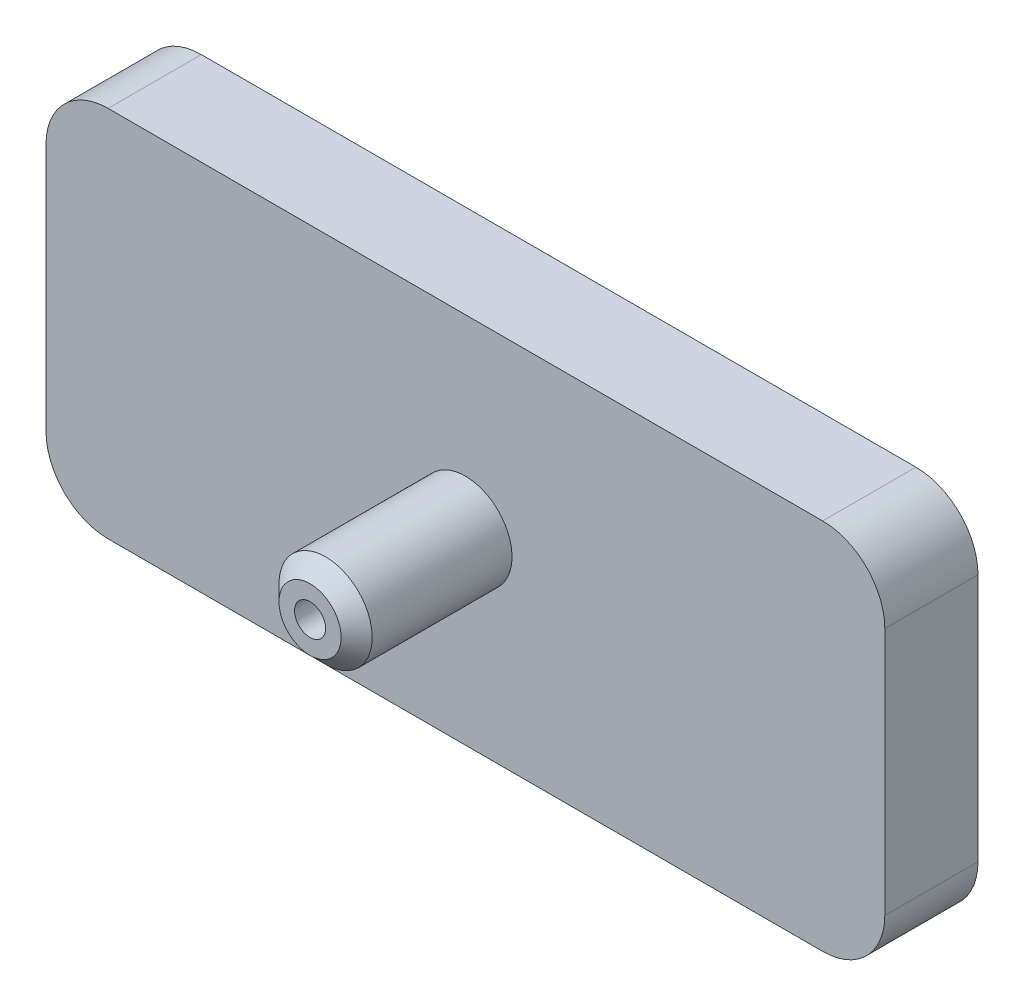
ISO-10303-21;
HEADER;
FILE_DESCRIPTION(('STEP AP214'),'2;1');
FILE_NAME('part.step','',(''),(''),'','','');
FILE_SCHEMA(('AUTOMOTIVE_DESIGN { 1 0 10303 214 1 1 1 1 }'));
ENDSEC;
DATA;
#1=APPLICATION_CONTEXT('core data for automotive mechanical design processes');
#2=APPLICATION_PROTOCOL_DEFINITION('international standard','automotive_design',2000,#1);
#3=PRODUCT_CONTEXT('',#1,'mechanical');
#4=PRODUCT('Part','Part','',(#3));
#5=PRODUCT_RELATED_PRODUCT_CATEGORY('part','',(#4));
#6=PRODUCT_DEFINITION_FORMATION('','',#4);
#7=PRODUCT_DEFINITION_CONTEXT('part definition',#1,'design');
#8=PRODUCT_DEFINITION('design','',#6,#7);
#9=PRODUCT_DEFINITION_SHAPE('','',#8);
#10=(LENGTH_UNIT() NAMED_UNIT(*) SI_UNIT(.MILLI.,.METRE.));
#11=(NAMED_UNIT(*) PLANE_ANGLE_UNIT() SI_UNIT($,.RADIAN.));
#12=(NAMED_UNIT(*) SI_UNIT($,.STERADIAN.) SOLID_ANGLE_UNIT());
#13=UNCERTAINTY_MEASURE_WITH_UNIT(LENGTH_MEASURE(1.E-05),#10,'distance_accuracy_value','');
#14=(GEOMETRIC_REPRESENTATION_CONTEXT(3) GLOBAL_UNCERTAINTY_ASSIGNED_CONTEXT((#13)) GLOBAL_UNIT_ASSIGNED_CONTEXT((#10,
#11,#12)) REPRESENTATION_CONTEXT('',''));
#15=CARTESIAN_POINT('',(0.,0.,0.));
#16=DIRECTION('',(0.,0.,1.));
#17=DIRECTION('',(1.,0.,0.));
#18=AXIS2_PLACEMENT_3D('',#15,#16,#17);
#19=CARTESIAN_POINT('',(-11.5,-4.,3.));
#20=DIRECTION('',(0.,0.,-1.));
#21=DIRECTION('',(-1.,0.,0.));
#22=AXIS2_PLACEMENT_3D('',#19,#20,#21);
#23=PLANE('',#22);
#24=CARTESIAN_POINT('',(0.,0.,3.));
#25=DIRECTION('',(0.,0.,-1.));
#26=DIRECTION('',(-1.,0.,0.));
#27=AXIS2_PLACEMENT_3D('',#24,#25,#26);
#28=CIRCLE('',#27,1.5);
#29=CARTESIAN_POINT('',(-1.5,0.,3.));
#30=VERTEX_POINT('',#29);
#31=EDGE_CURVE('E272',#30,#30,#28,.T.);
#32=ORIENTED_EDGE('',*,*,#31,.T.);
#33=EDGE_LOOP('',(#32));
#34=FACE_BOUND('',#33,.T.);
#35=CARTESIAN_POINT('',(-11.5,-4.,3.));
#36=DIRECTION('',(0.,0.,1.));
#37=DIRECTION('',(-1.,0.,0.));
#38=AXIS2_PLACEMENT_3D('',#35,#36,#37);
#39=CIRCLE('',#38,2.);
#40=CARTESIAN_POINT('',(-13.5,-4.,3.));
#41=VERTEX_POINT('',#40);
#42=CARTESIAN_POINT('',(-11.5,-6.,3.));
#43=VERTEX_POINT('',#42);
#44=EDGE_CURVE('E155',#41,#43,#39,.T.);
#45=ORIENTED_EDGE('',*,*,#44,.T.);
#46=DIRECTION('',(1.,0.,0.));
#47=VECTOR('',#46,1.);
#48=CARTESIAN_POINT('',(-11.5,-6.,3.));
#49=LINE('',#48,#47);
#50=CARTESIAN_POINT('',(11.5,-6.,3.));
#51=VERTEX_POINT('',#50);
#52=EDGE_CURVE('E97',#43,#51,#49,.T.);
#53=ORIENTED_EDGE('',*,*,#52,.T.);
#54=CARTESIAN_POINT('',(11.5,-4.,3.));
#55=DIRECTION('',(0.,0.,1.));
#56=DIRECTION('',(1.,0.,0.));
#57=AXIS2_PLACEMENT_3D('',#54,#55,#56);
#58=CIRCLE('',#57,2.);
#59=CARTESIAN_POINT('',(13.5,-4.,3.));
#60=VERTEX_POINT('',#59);
#61=EDGE_CURVE('E171',#51,#60,#58,.T.);
#62=ORIENTED_EDGE('',*,*,#61,.T.);
#63=DIRECTION('',(0.,1.,0.));
#64=VECTOR('',#63,1.);
#65=CARTESIAN_POINT('',(13.5,-4.,3.));
#66=LINE('',#65,#64);
#67=CARTESIAN_POINT('',(13.5,4.,3.));
#68=VERTEX_POINT('',#67);
#69=EDGE_CURVE('E183',#60,#68,#66,.T.);
#70=ORIENTED_EDGE('',*,*,#69,.T.);
#71=CARTESIAN_POINT('',(11.5,4.,3.));
#72=DIRECTION('',(0.,0.,1.));
#73=DIRECTION('',(-1.,0.,0.));
#74=AXIS2_PLACEMENT_3D('',#71,#72,#73);
#75=CIRCLE('',#74,2.);
#76=CARTESIAN_POINT('',(11.5,6.,3.));
#77=VERTEX_POINT('',#76);
#78=EDGE_CURVE('E119',#68,#77,#75,.T.);
#79=ORIENTED_EDGE('',*,*,#78,.T.);
#80=DIRECTION('',(-1.,0.,0.));
#81=VECTOR('',#80,1.);
#82=CARTESIAN_POINT('',(-11.5,6.,3.));
#83=LINE('',#82,#81);
#84=CARTESIAN_POINT('',(-11.5,6.,3.));
#85=VERTEX_POINT('',#84);
#86=EDGE_CURVE('E113',#77,#85,#83,.T.);
#87=ORIENTED_EDGE('',*,*,#86,.T.);
#88=CARTESIAN_POINT('',(-11.5,4.,3.));
#89=DIRECTION('',(0.,0.,1.));
#90=DIRECTION('',(-1.,0.,0.));
#91=AXIS2_PLACEMENT_3D('',#88,#89,#90);
#92=CIRCLE('',#91,2.);
#93=CARTESIAN_POINT('',(-13.5,4.,3.));
#94=VERTEX_POINT('',#93);
#95=EDGE_CURVE('E116',#85,#94,#92,.T.);
#96=ORIENTED_EDGE('',*,*,#95,.T.);
#97=DIRECTION('',(0.,-1.,0.));
#98=VECTOR('',#97,1.);
#99=CARTESIAN_POINT('',(-13.5,-4.,3.));
#100=LINE('',#99,#98);
#101=EDGE_CURVE('E56',#94,#41,#100,.T.);
#102=ORIENTED_EDGE('',*,*,#101,.T.);
#103=EDGE_LOOP('',(#45,#53,#62,#70,#79,#87,#96,#102));
#104=FACE_BOUND('',#103,.T.);
#105=ADVANCED_FACE('F31',(#34,#104),#23,.F.);
#106=CARTESIAN_POINT('',(-11.5,-4.,0.));
#107=DIRECTION('',(0.,0.,-1.));
#108=DIRECTION('',(-1.,0.,0.));
#109=AXIS2_PLACEMENT_3D('',#106,#107,#108);
#110=PLANE('',#109);
#111=CARTESIAN_POINT('',(-11.5,4.,0.));
#112=DIRECTION('',(0.,0.,-1.));
#113=DIRECTION('',(1.,0.,0.));
#114=AXIS2_PLACEMENT_3D('',#111,#112,#113);
#115=CIRCLE('',#114,0.999999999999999);
#116=CARTESIAN_POINT('',(-12.5,4.,0.));
#117=VERTEX_POINT('',#116);
#118=CARTESIAN_POINT('',(-11.5,5.,0.));
#119=VERTEX_POINT('',#118);
#120=EDGE_CURVE('E47',#117,#119,#115,.T.);
#121=ORIENTED_EDGE('',*,*,#120,.F.);
#122=DIRECTION('',(0.,1.,0.));
#123=VECTOR('',#122,1.);
#124=CARTESIAN_POINT('',(-12.5,-4.,0.));
#125=LINE('',#124,#123);
#126=CARTESIAN_POINT('',(-12.5,-4.,0.));
#127=VERTEX_POINT('',#126);
#128=EDGE_CURVE('E212',#127,#117,#125,.T.);
#129=ORIENTED_EDGE('',*,*,#128,.F.);
#130=CARTESIAN_POINT('',(-11.5,-4.,0.));
#131=DIRECTION('',(0.,0.,-1.));
#132=DIRECTION('',(-1.,0.,0.));
#133=AXIS2_PLACEMENT_3D('',#130,#131,#132);
#134=CIRCLE('',#133,0.999999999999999);
#135=CARTESIAN_POINT('',(-11.5,-5.,0.));
#136=VERTEX_POINT('',#135);
#137=EDGE_CURVE('E216',#136,#127,#134,.T.);
#138=ORIENTED_EDGE('',*,*,#137,.F.);
#139=DIRECTION('',(-1.,0.,0.));
#140=VECTOR('',#139,1.);
#141=CARTESIAN_POINT('',(11.5,-5.,0.));
#142=LINE('',#141,#140);
#143=CARTESIAN_POINT('',(11.5,-5.,0.));
#144=VERTEX_POINT('',#143);
#145=EDGE_CURVE('E219',#144,#136,#142,.T.);
#146=ORIENTED_EDGE('',*,*,#145,.F.);
#147=CARTESIAN_POINT('',(11.5,-4.,0.));
#148=DIRECTION('',(0.,0.,-1.));
#149=DIRECTION('',(1.,0.,0.));
#150=AXIS2_PLACEMENT_3D('',#147,#148,#149);
#151=CIRCLE('',#150,0.999999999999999);
#152=CARTESIAN_POINT('',(12.5,-4.,0.));
#153=VERTEX_POINT('',#152);
#154=EDGE_CURVE('E222',#153,#144,#151,.T.);
#155=ORIENTED_EDGE('',*,*,#154,.F.);
#156=DIRECTION('',(0.,-1.,0.));
#157=VECTOR('',#156,1.);
#158=CARTESIAN_POINT('',(12.5,-4.,0.));
#159=LINE('',#158,#157);
#160=CARTESIAN_POINT('',(12.5,4.,0.));
#161=VERTEX_POINT('',#160);
#162=EDGE_CURVE('E225',#161,#153,#159,.T.);
#163=ORIENTED_EDGE('',*,*,#162,.F.);
#164=CARTESIAN_POINT('',(11.5,4.,0.));
#165=DIRECTION('',(0.,0.,-1.));
#166=DIRECTION('',(1.,0.,0.));
#167=AXIS2_PLACEMENT_3D('',#164,#165,#166);
#168=CIRCLE('',#167,0.999999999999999);
#169=CARTESIAN_POINT('',(11.5,5.,0.));
#170=VERTEX_POINT('',#169);
#171=EDGE_CURVE('E228',#170,#161,#168,.T.);
#172=ORIENTED_EDGE('',*,*,#171,.F.);
#173=DIRECTION('',(1.,0.,0.));
#174=VECTOR('',#173,1.);
#175=CARTESIAN_POINT('',(11.5,5.,0.));
#176=LINE('',#175,#174);
#177=EDGE_CURVE('E231',#119,#170,#176,.T.);
#178=ORIENTED_EDGE('',*,*,#177,.F.);
#179=EDGE_LOOP('',(#121,#129,#138,#146,#155,#163,#172,#178));
#180=FACE_BOUND('',#179,.T.);
#181=CARTESIAN_POINT('',(-11.5,-4.,0.));
#182=DIRECTION('',(0.,0.,1.));
#183=DIRECTION('',(-1.,0.,0.));
#184=AXIS2_PLACEMENT_3D('',#181,#182,#183);
#185=CIRCLE('',#184,2.);
#186=CARTESIAN_POINT('',(-13.5,-4.,0.));
#187=VERTEX_POINT('',#186);
#188=CARTESIAN_POINT('',(-11.5,-6.,0.));
#189=VERTEX_POINT('',#188);
#190=EDGE_CURVE('E140',#187,#189,#185,.T.);
#191=ORIENTED_EDGE('',*,*,#190,.F.);
#192=DIRECTION('',(0.,-1.,0.));
#193=VECTOR('',#192,1.);
#194=CARTESIAN_POINT('',(-13.5,-4.,0.));
#195=LINE('',#194,#193);
#196=CARTESIAN_POINT('',(-13.5,4.,0.));
#197=VERTEX_POINT('',#196);
#198=EDGE_CURVE('E89',#197,#187,#195,.T.);
#199=ORIENTED_EDGE('',*,*,#198,.F.);
#200=CARTESIAN_POINT('',(-11.5,4.,0.));
#201=DIRECTION('',(0.,0.,1.));
#202=DIRECTION('',(-1.,0.,0.));
#203=AXIS2_PLACEMENT_3D('',#200,#201,#202);
#204=CIRCLE('',#203,2.);
#205=CARTESIAN_POINT('',(-11.5,6.,0.));
#206=VERTEX_POINT('',#205);
#207=EDGE_CURVE('E152',#206,#197,#204,.T.);
#208=ORIENTED_EDGE('',*,*,#207,.F.);
#209=DIRECTION('',(-1.,0.,0.));
#210=VECTOR('',#209,1.);
#211=CARTESIAN_POINT('',(-11.5,6.,0.));
#212=LINE('',#211,#210);
#213=CARTESIAN_POINT('',(11.5,6.,0.));
#214=VERTEX_POINT('',#213);
#215=EDGE_CURVE('E128',#214,#206,#212,.T.);
#216=ORIENTED_EDGE('',*,*,#215,.F.);
#217=CARTESIAN_POINT('',(11.5,4.,0.));
#218=DIRECTION('',(0.,0.,1.));
#219=DIRECTION('',(-1.,0.,0.));
#220=AXIS2_PLACEMENT_3D('',#217,#218,#219);
#221=CIRCLE('',#220,2.);
#222=CARTESIAN_POINT('',(13.5,4.,0.));
#223=VERTEX_POINT('',#222);
#224=EDGE_CURVE('E149',#223,#214,#221,.T.);
#225=ORIENTED_EDGE('',*,*,#224,.F.);
#226=DIRECTION('',(0.,1.,0.));
#227=VECTOR('',#226,1.);
#228=CARTESIAN_POINT('',(13.5,-4.,0.));
#229=LINE('',#228,#227);
#230=CARTESIAN_POINT('',(13.5,-4.,0.));
#231=VERTEX_POINT('',#230);
#232=EDGE_CURVE('E147',#231,#223,#229,.T.);
#233=ORIENTED_EDGE('',*,*,#232,.F.);
#234=CARTESIAN_POINT('',(11.5,-4.,0.));
#235=DIRECTION('',(0.,0.,1.));
#236=DIRECTION('',(1.,0.,0.));
#237=AXIS2_PLACEMENT_3D('',#234,#235,#236);
#238=CIRCLE('',#237,2.);
#239=CARTESIAN_POINT('',(11.5,-6.,0.));
#240=VERTEX_POINT('',#239);
#241=EDGE_CURVE('E145',#240,#231,#238,.T.);
#242=ORIENTED_EDGE('',*,*,#241,.F.);
#243=DIRECTION('',(1.,0.,0.));
#244=VECTOR('',#243,1.);
#245=CARTESIAN_POINT('',(-11.5,-6.,0.));
#246=LINE('',#245,#244);
#247=EDGE_CURVE('E143',#189,#240,#246,.T.);
#248=ORIENTED_EDGE('',*,*,#247,.F.);
#249=EDGE_LOOP('',(#191,#199,#208,#216,#225,#233,#242,#248));
#250=FACE_BOUND('',#249,.T.);
#251=ADVANCED_FACE('F175',(#180,#250),#110,.T.);
#252=CARTESIAN_POINT('',(-11.5,-4.,3.));
#253=DIRECTION('',(0.,0.,-1.));
#254=DIRECTION('',(-1.,0.,0.));
#255=AXIS2_PLACEMENT_3D('',#252,#253,#254);
#256=CYLINDRICAL_SURFACE('',#255,2.);
#257=ORIENTED_EDGE('',*,*,#190,.T.);
#258=DIRECTION('',(0.,0.,-1.));
#259=VECTOR('',#258,1.);
#260=CARTESIAN_POINT('',(-11.5,-6.,3.));
#261=LINE('',#260,#259);
#262=EDGE_CURVE('E11',#43,#189,#261,.T.);
#263=ORIENTED_EDGE('',*,*,#262,.F.);
#264=ORIENTED_EDGE('',*,*,#44,.F.);
#265=DIRECTION('',(0.,0.,-1.));
#266=VECTOR('',#265,1.);
#267=CARTESIAN_POINT('',(-13.5,-4.,3.));
#268=LINE('',#267,#266);
#269=EDGE_CURVE('E136',#41,#187,#268,.T.);
#270=ORIENTED_EDGE('',*,*,#269,.T.);
#271=EDGE_LOOP('',(#257,#263,#264,#270));
#272=FACE_BOUND('',#271,.T.);
#273=ADVANCED_FACE('F33',(#272),#256,.T.);
#274=CARTESIAN_POINT('',(-11.5,-6.,3.));
#275=DIRECTION('',(0.,1.,0.));
#276=DIRECTION('',(0.,0.,1.));
#277=AXIS2_PLACEMENT_3D('',#274,#275,#276);
#278=PLANE('',#277);
#279=ORIENTED_EDGE('',*,*,#247,.T.);
#280=DIRECTION('',(0.,0.,-1.));
#281=VECTOR('',#280,1.);
#282=CARTESIAN_POINT('',(11.5,-6.,3.));
#283=LINE('',#282,#281);
#284=EDGE_CURVE('E40',#51,#240,#283,.T.);
#285=ORIENTED_EDGE('',*,*,#284,.F.);
#286=ORIENTED_EDGE('',*,*,#52,.F.);
#287=ORIENTED_EDGE('',*,*,#262,.T.);
#288=EDGE_LOOP('',(#279,#285,#286,#287));
#289=FACE_BOUND('',#288,.T.);
#290=ADVANCED_FACE('F311',(#289),#278,.F.);
#291=CARTESIAN_POINT('',(11.5,-4.,3.));
#292=DIRECTION('',(0.,0.,-1.));
#293=DIRECTION('',(-1.,0.,0.));
#294=AXIS2_PLACEMENT_3D('',#291,#292,#293);
#295=CYLINDRICAL_SURFACE('',#294,2.);
#296=ORIENTED_EDGE('',*,*,#241,.T.);
#297=DIRECTION('',(0.,0.,-1.));
#298=VECTOR('',#297,1.);
#299=CARTESIAN_POINT('',(13.5,-4.,3.));
#300=LINE('',#299,#298);
#301=EDGE_CURVE('E162',#60,#231,#300,.T.);
#302=ORIENTED_EDGE('',*,*,#301,.F.);
#303=ORIENTED_EDGE('',*,*,#61,.F.);
#304=ORIENTED_EDGE('',*,*,#284,.T.);
#305=EDGE_LOOP('',(#296,#302,#303,#304));
#306=FACE_BOUND('',#305,.T.);
#307=ADVANCED_FACE('F169',(#306),#295,.T.);
#308=CARTESIAN_POINT('',(13.5,-4.,3.));
#309=DIRECTION('',(-1.,0.,0.));
#310=DIRECTION('',(0.,0.,1.));
#311=AXIS2_PLACEMENT_3D('',#308,#309,#310);
#312=PLANE('',#311);
#313=ORIENTED_EDGE('',*,*,#232,.T.);
#314=DIRECTION('',(0.,0.,-1.));
#315=VECTOR('',#314,1.);
#316=CARTESIAN_POINT('',(13.5,4.,3.));
#317=LINE('',#316,#315);
#318=EDGE_CURVE('E159',#68,#223,#317,.T.);
#319=ORIENTED_EDGE('',*,*,#318,.F.);
#320=ORIENTED_EDGE('',*,*,#69,.F.);
#321=ORIENTED_EDGE('',*,*,#301,.T.);
#322=EDGE_LOOP('',(#313,#319,#320,#321));
#323=FACE_BOUND('',#322,.T.);
#324=ADVANCED_FACE('F179',(#323),#312,.F.);
#325=CARTESIAN_POINT('',(11.5,4.,3.));
#326=DIRECTION('',(0.,0.,-1.));
#327=DIRECTION('',(-1.,0.,0.));
#328=AXIS2_PLACEMENT_3D('',#325,#326,#327);
#329=CYLINDRICAL_SURFACE('',#328,2.);
#330=ORIENTED_EDGE('',*,*,#224,.T.);
#331=DIRECTION('',(0.,0.,-1.));
#332=VECTOR('',#331,1.);
#333=CARTESIAN_POINT('',(11.5,6.,3.));
#334=LINE('',#333,#332);
#335=EDGE_CURVE('E131',#77,#214,#334,.T.);
#336=ORIENTED_EDGE('',*,*,#335,.F.);
#337=ORIENTED_EDGE('',*,*,#78,.F.);
#338=ORIENTED_EDGE('',*,*,#318,.T.);
#339=EDGE_LOOP('',(#330,#336,#337,#338));
#340=FACE_BOUND('',#339,.T.);
#341=ADVANCED_FACE('F182',(#340),#329,.T.);
#342=CARTESIAN_POINT('',(-11.5,6.,3.));
#343=DIRECTION('',(0.,-1.,0.));
#344=DIRECTION('',(0.,0.,-1.));
#345=AXIS2_PLACEMENT_3D('',#342,#343,#344);
#346=PLANE('',#345);
#347=ORIENTED_EDGE('',*,*,#215,.T.);
#348=DIRECTION('',(0.,0.,-1.));
#349=VECTOR('',#348,1.);
#350=CARTESIAN_POINT('',(-11.5,6.,3.));
#351=LINE('',#350,#349);
#352=EDGE_CURVE('E125',#85,#206,#351,.T.);
#353=ORIENTED_EDGE('',*,*,#352,.F.);
#354=ORIENTED_EDGE('',*,*,#86,.F.);
#355=ORIENTED_EDGE('',*,*,#335,.T.);
#356=EDGE_LOOP('',(#347,#353,#354,#355));
#357=FACE_BOUND('',#356,.T.);
#358=ADVANCED_FACE('F126',(#357),#346,.F.);
#359=CARTESIAN_POINT('',(-11.5,4.,3.));
#360=DIRECTION('',(0.,0.,-1.));
#361=DIRECTION('',(-1.,0.,0.));
#362=AXIS2_PLACEMENT_3D('',#359,#360,#361);
#363=CYLINDRICAL_SURFACE('',#362,2.);
#364=ORIENTED_EDGE('',*,*,#207,.T.);
#365=DIRECTION('',(0.,0.,-1.));
#366=VECTOR('',#365,1.);
#367=CARTESIAN_POINT('',(-13.5,4.,3.));
#368=LINE('',#367,#366);
#369=EDGE_CURVE('E132',#94,#197,#368,.T.);
#370=ORIENTED_EDGE('',*,*,#369,.F.);
#371=ORIENTED_EDGE('',*,*,#95,.F.);
#372=ORIENTED_EDGE('',*,*,#352,.T.);
#373=EDGE_LOOP('',(#364,#370,#371,#372));
#374=FACE_BOUND('',#373,.T.);
#375=ADVANCED_FACE('F134',(#374),#363,.T.);
#376=CARTESIAN_POINT('',(-13.5,-4.,3.));
#377=DIRECTION('',(1.,0.,0.));
#378=DIRECTION('',(0.,0.,-1.));
#379=AXIS2_PLACEMENT_3D('',#376,#377,#378);
#380=PLANE('',#379);
#381=ORIENTED_EDGE('',*,*,#198,.T.);
#382=ORIENTED_EDGE('',*,*,#269,.F.);
#383=ORIENTED_EDGE('',*,*,#101,.F.);
#384=ORIENTED_EDGE('',*,*,#369,.T.);
#385=EDGE_LOOP('',(#381,#382,#383,#384));
#386=FACE_BOUND('',#385,.T.);
#387=ADVANCED_FACE('F299',(#386),#380,.F.);
#388=CARTESIAN_POINT('',(0.,0.,3.));
#389=DIRECTION('',(0.,0.,-1.));
#390=DIRECTION('',(-1.,0.,0.));
#391=AXIS2_PLACEMENT_3D('',#388,#389,#390);
#392=CYLINDRICAL_SURFACE('',#391,1.);
#393=CARTESIAN_POINT('',(0.,0.,2.));
#394=DIRECTION('',(0.,0.,1.));
#395=DIRECTION('',(1.,0.,0.));
#396=AXIS2_PLACEMENT_3D('',#393,#394,#395);
#397=CIRCLE('',#396,1.);
#398=CARTESIAN_POINT('',(1.00000000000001,0.,2.));
#399=VERTEX_POINT('',#398);
#400=EDGE_CURVE('E35',#399,#399,#397,.T.);
#401=ORIENTED_EDGE('',*,*,#400,.F.);
#402=EDGE_LOOP('',(#401));
#403=FACE_BOUND('',#402,.T.);
#404=CARTESIAN_POINT('',(0.,0.,3.));
#405=DIRECTION('',(0.,0.,-1.));
#406=DIRECTION('',(-1.,0.,0.));
#407=AXIS2_PLACEMENT_3D('',#404,#405,#406);
#408=CIRCLE('',#407,1.);
#409=CARTESIAN_POINT('',(-0.999999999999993,0.,3.));
#410=VERTEX_POINT('',#409);
#411=EDGE_CURVE('E235',#410,#410,#408,.T.);
#412=ORIENTED_EDGE('',*,*,#411,.F.);
#413=EDGE_LOOP('',(#412));
#414=FACE_BOUND('',#413,.T.);
#415=ADVANCED_FACE('F296',(#403,#414),#392,.F.);
#416=CARTESIAN_POINT('',(-11.5,4.,2.));
#417=DIRECTION('',(0.,0.,-1.));
#418=DIRECTION('',(-1.,0.,0.));
#419=AXIS2_PLACEMENT_3D('',#416,#417,#418);
#420=CYLINDRICAL_SURFACE('',#419,0.999999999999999);
#421=ORIENTED_EDGE('',*,*,#120,.T.);
#422=DIRECTION('',(0.,0.,-1.));
#423=VECTOR('',#422,1.);
#424=CARTESIAN_POINT('',(-11.5,5.,2.));
#425=LINE('',#424,#423);
#426=CARTESIAN_POINT('',(-11.5,5.,2.));
#427=VERTEX_POINT('',#426);
#428=EDGE_CURVE('E189',#427,#119,#425,.T.);
#429=ORIENTED_EDGE('',*,*,#428,.F.);
#430=CARTESIAN_POINT('',(-11.5,4.,2.));
#431=DIRECTION('',(0.,0.,-1.));
#432=DIRECTION('',(1.,0.,0.));
#433=AXIS2_PLACEMENT_3D('',#430,#431,#432);
#434=CIRCLE('',#433,0.999999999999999);
#435=CARTESIAN_POINT('',(-12.5,4.,2.));
#436=VERTEX_POINT('',#435);
#437=EDGE_CURVE('E215',#436,#427,#434,.T.);
#438=ORIENTED_EDGE('',*,*,#437,.F.);
#439=DIRECTION('',(0.,0.,-1.));
#440=VECTOR('',#439,1.);
#441=CARTESIAN_POINT('',(-12.5,4.,2.));
#442=LINE('',#441,#440);
#443=EDGE_CURVE('E210',#436,#117,#442,.T.);
#444=ORIENTED_EDGE('',*,*,#443,.T.);
#445=EDGE_LOOP('',(#421,#429,#438,#444));
#446=FACE_BOUND('',#445,.T.);
#447=ADVANCED_FACE('F339',(#446),#420,.F.);
#448=CARTESIAN_POINT('',(-12.5,-4.,2.));
#449=DIRECTION('',(-1.,0.,0.));
#450=DIRECTION('',(0.,0.,1.));
#451=AXIS2_PLACEMENT_3D('',#448,#449,#450);
#452=PLANE('',#451);
#453=ORIENTED_EDGE('',*,*,#128,.T.);
#454=ORIENTED_EDGE('',*,*,#443,.F.);
#455=DIRECTION('',(0.,1.,0.));
#456=VECTOR('',#455,1.);
#457=CARTESIAN_POINT('',(-12.5,-4.,2.));
#458=LINE('',#457,#456);
#459=CARTESIAN_POINT('',(-12.5,-4.,2.));
#460=VERTEX_POINT('',#459);
#461=EDGE_CURVE('E192',#460,#436,#458,.T.);
#462=ORIENTED_EDGE('',*,*,#461,.F.);
#463=DIRECTION('',(0.,0.,-1.));
#464=VECTOR('',#463,1.);
#465=CARTESIAN_POINT('',(-12.5,-4.,2.));
#466=LINE('',#465,#464);
#467=EDGE_CURVE('E207',#460,#127,#466,.T.);
#468=ORIENTED_EDGE('',*,*,#467,.T.);
#469=EDGE_LOOP('',(#453,#454,#462,#468));
#470=FACE_BOUND('',#469,.T.);
#471=ADVANCED_FACE('F348',(#470),#452,.F.);
#472=CARTESIAN_POINT('',(-11.5,-4.,2.));
#473=DIRECTION('',(0.,0.,-1.));
#474=DIRECTION('',(-1.,0.,0.));
#475=AXIS2_PLACEMENT_3D('',#472,#473,#474);
#476=CYLINDRICAL_SURFACE('',#475,0.999999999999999);
#477=ORIENTED_EDGE('',*,*,#137,.T.);
#478=ORIENTED_EDGE('',*,*,#467,.F.);
#479=CARTESIAN_POINT('',(-11.5,-4.,2.));
#480=DIRECTION('',(0.,0.,-1.));
#481=DIRECTION('',(-1.,0.,0.));
#482=AXIS2_PLACEMENT_3D('',#479,#480,#481);
#483=CIRCLE('',#482,0.999999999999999);
#484=CARTESIAN_POINT('',(-11.5,-5.,2.));
#485=VERTEX_POINT('',#484);
#486=EDGE_CURVE('E238',#485,#460,#483,.T.);
#487=ORIENTED_EDGE('',*,*,#486,.F.);
#488=DIRECTION('',(0.,0.,-1.));
#489=VECTOR('',#488,1.);
#490=CARTESIAN_POINT('',(-11.5,-5.,2.));
#491=LINE('',#490,#489);
#492=EDGE_CURVE('E204',#485,#136,#491,.T.);
#493=ORIENTED_EDGE('',*,*,#492,.T.);
#494=EDGE_LOOP('',(#477,#478,#487,#493));
#495=FACE_BOUND('',#494,.T.);
#496=ADVANCED_FACE('F356',(#495),#476,.F.);
#497=CARTESIAN_POINT('',(11.5,-5.,2.));
#498=DIRECTION('',(0.,-1.,0.));
#499=DIRECTION('',(0.,0.,-1.));
#500=AXIS2_PLACEMENT_3D('',#497,#498,#499);
#501=PLANE('',#500);
#502=ORIENTED_EDGE('',*,*,#145,.T.);
#503=ORIENTED_EDGE('',*,*,#492,.F.);
#504=DIRECTION('',(-1.,0.,0.));
#505=VECTOR('',#504,1.);
#506=CARTESIAN_POINT('',(11.5,-5.,2.));
#507=LINE('',#506,#505);
#508=CARTESIAN_POINT('',(11.5,-5.,2.));
#509=VERTEX_POINT('',#508);
#510=EDGE_CURVE('E241',#509,#485,#507,.T.);
#511=ORIENTED_EDGE('',*,*,#510,.F.);
#512=DIRECTION('',(0.,0.,-1.));
#513=VECTOR('',#512,1.);
#514=CARTESIAN_POINT('',(11.5,-5.,2.));
#515=LINE('',#514,#513);
#516=EDGE_CURVE('E201',#509,#144,#515,.T.);
#517=ORIENTED_EDGE('',*,*,#516,.T.);
#518=EDGE_LOOP('',(#502,#503,#511,#517));
#519=FACE_BOUND('',#518,.T.);
#520=ADVANCED_FACE('F366',(#519),#501,.F.);
#521=CARTESIAN_POINT('',(11.5,-4.,2.));
#522=DIRECTION('',(0.,0.,-1.));
#523=DIRECTION('',(-1.,0.,0.));
#524=AXIS2_PLACEMENT_3D('',#521,#522,#523);
#525=CYLINDRICAL_SURFACE('',#524,0.999999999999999);
#526=ORIENTED_EDGE('',*,*,#154,.T.);
#527=ORIENTED_EDGE('',*,*,#516,.F.);
#528=CARTESIAN_POINT('',(11.5,-4.,2.));
#529=DIRECTION('',(0.,0.,-1.));
#530=DIRECTION('',(1.,0.,0.));
#531=AXIS2_PLACEMENT_3D('',#528,#529,#530);
#532=CIRCLE('',#531,0.999999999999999);
#533=CARTESIAN_POINT('',(12.5,-4.,2.));
#534=VERTEX_POINT('',#533);
#535=EDGE_CURVE('E244',#534,#509,#532,.T.);
#536=ORIENTED_EDGE('',*,*,#535,.F.);
#537=DIRECTION('',(0.,0.,-1.));
#538=VECTOR('',#537,1.);
#539=CARTESIAN_POINT('',(12.5,-4.,2.));
#540=LINE('',#539,#538);
#541=EDGE_CURVE('E198',#534,#153,#540,.T.);
#542=ORIENTED_EDGE('',*,*,#541,.T.);
#543=EDGE_LOOP('',(#526,#527,#536,#542));
#544=FACE_BOUND('',#543,.T.);
#545=ADVANCED_FACE('F376',(#544),#525,.F.);
#546=CARTESIAN_POINT('',(12.5,-4.,2.));
#547=DIRECTION('',(1.,0.,0.));
#548=DIRECTION('',(0.,0.,-1.));
#549=AXIS2_PLACEMENT_3D('',#546,#547,#548);
#550=PLANE('',#549);
#551=ORIENTED_EDGE('',*,*,#162,.T.);
#552=ORIENTED_EDGE('',*,*,#541,.F.);
#553=DIRECTION('',(0.,-1.,0.));
#554=VECTOR('',#553,1.);
#555=CARTESIAN_POINT('',(12.5,-4.,2.));
#556=LINE('',#555,#554);
#557=CARTESIAN_POINT('',(12.5,4.,2.));
#558=VERTEX_POINT('',#557);
#559=EDGE_CURVE('E247',#558,#534,#556,.T.);
#560=ORIENTED_EDGE('',*,*,#559,.F.);
#561=DIRECTION('',(0.,0.,-1.));
#562=VECTOR('',#561,1.);
#563=CARTESIAN_POINT('',(12.5,4.,2.));
#564=LINE('',#563,#562);
#565=EDGE_CURVE('E195',#558,#161,#564,.T.);
#566=ORIENTED_EDGE('',*,*,#565,.T.);
#567=EDGE_LOOP('',(#551,#552,#560,#566));
#568=FACE_BOUND('',#567,.T.);
#569=ADVANCED_FACE('F386',(#568),#550,.F.);
#570=CARTESIAN_POINT('',(11.5,4.,2.));
#571=DIRECTION('',(0.,0.,-1.));
#572=DIRECTION('',(-1.,0.,0.));
#573=AXIS2_PLACEMENT_3D('',#570,#571,#572);
#574=CYLINDRICAL_SURFACE('',#573,0.999999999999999);
#575=ORIENTED_EDGE('',*,*,#171,.T.);
#576=ORIENTED_EDGE('',*,*,#565,.F.);
#577=CARTESIAN_POINT('',(11.5,4.,2.));
#578=DIRECTION('',(0.,0.,-1.));
#579=DIRECTION('',(1.,0.,0.));
#580=AXIS2_PLACEMENT_3D('',#577,#578,#579);
#581=CIRCLE('',#580,0.999999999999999);
#582=CARTESIAN_POINT('',(11.5,5.,2.));
#583=VERTEX_POINT('',#582);
#584=EDGE_CURVE('E250',#583,#558,#581,.T.);
#585=ORIENTED_EDGE('',*,*,#584,.F.);
#586=DIRECTION('',(0.,0.,-1.));
#587=VECTOR('',#586,1.);
#588=CARTESIAN_POINT('',(11.5,5.,2.));
#589=LINE('',#588,#587);
#590=EDGE_CURVE('E191',#583,#170,#589,.T.);
#591=ORIENTED_EDGE('',*,*,#590,.T.);
#592=EDGE_LOOP('',(#575,#576,#585,#591));
#593=FACE_BOUND('',#592,.T.);
#594=ADVANCED_FACE('F396',(#593),#574,.F.);
#595=CARTESIAN_POINT('',(11.5,5.,2.));
#596=DIRECTION('',(0.,1.,0.));
#597=DIRECTION('',(0.,0.,1.));
#598=AXIS2_PLACEMENT_3D('',#595,#596,#597);
#599=PLANE('',#598);
#600=ORIENTED_EDGE('',*,*,#177,.T.);
#601=ORIENTED_EDGE('',*,*,#590,.F.);
#602=DIRECTION('',(1.,0.,0.));
#603=VECTOR('',#602,1.);
#604=CARTESIAN_POINT('',(11.5,5.,2.));
#605=LINE('',#604,#603);
#606=EDGE_CURVE('E253',#427,#583,#605,.T.);
#607=ORIENTED_EDGE('',*,*,#606,.F.);
#608=ORIENTED_EDGE('',*,*,#428,.T.);
#609=EDGE_LOOP('',(#600,#601,#607,#608));
#610=FACE_BOUND('',#609,.T.);
#611=ADVANCED_FACE('F406',(#610),#599,.F.);
#612=CARTESIAN_POINT('',(-11.5,4.,2.));
#613=DIRECTION('',(0.,0.,1.));
#614=DIRECTION('',(1.,0.,0.));
#615=AXIS2_PLACEMENT_3D('',#612,#613,#614);
#616=PLANE('',#615);
#617=ORIENTED_EDGE('',*,*,#400,.T.);
#618=EDGE_LOOP('',(#617));
#619=FACE_BOUND('',#618,.T.);
#620=ORIENTED_EDGE('',*,*,#437,.T.);
#621=ORIENTED_EDGE('',*,*,#606,.T.);
#622=ORIENTED_EDGE('',*,*,#584,.T.);
#623=ORIENTED_EDGE('',*,*,#559,.T.);
#624=ORIENTED_EDGE('',*,*,#535,.T.);
#625=ORIENTED_EDGE('',*,*,#510,.T.);
#626=ORIENTED_EDGE('',*,*,#486,.T.);
#627=ORIENTED_EDGE('',*,*,#461,.T.);
#628=EDGE_LOOP('',(#620,#621,#622,#623,#624,#625,#626,#627));
#629=FACE_BOUND('',#628,.T.);
#630=ADVANCED_FACE('F416',(#619,#629),#616,.F.);
#631=CARTESIAN_POINT('',(0.,1.5,3.));
#632=DIRECTION('',(0.,0.,-1.));
#633=DIRECTION('',(-1.,0.,0.));
#634=AXIS2_PLACEMENT_3D('',#631,#632,#633);
#635=PLANE('',#634);
#636=ORIENTED_EDGE('',*,*,#411,.T.);
#637=EDGE_LOOP('',(#636));
#638=FACE_BOUND('',#637,.T.);
#639=CARTESIAN_POINT('',(0.,0.,3.));
#640=DIRECTION('',(0.,0.,-1.));
#641=DIRECTION('',(-1.,0.,0.));
#642=AXIS2_PLACEMENT_3D('',#639,#640,#641);
#643=CIRCLE('',#642,0.5);
#644=CARTESIAN_POINT('',(-0.5,0.,3.));
#645=VERTEX_POINT('',#644);
#646=EDGE_CURVE('E260',#645,#645,#643,.T.);
#647=ORIENTED_EDGE('',*,*,#646,.F.);
#648=EDGE_LOOP('',(#647));
#649=FACE_BOUND('',#648,.T.);
#650=ADVANCED_FACE('F425',(#638,#649),#635,.T.);
#651=CARTESIAN_POINT('',(0.,0.,0.));
#652=DIRECTION('',(0.,0.,-1.));
#653=DIRECTION('',(-1.,0.,0.));
#654=AXIS2_PLACEMENT_3D('',#651,#652,#653);
#655=CYLINDRICAL_SURFACE('',#654,0.499999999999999);
#656=ORIENTED_EDGE('',*,*,#646,.T.);
#657=EDGE_LOOP('',(#656));
#658=FACE_BOUND('',#657,.T.);
#659=CARTESIAN_POINT('',(0.,0.,8.));
#660=DIRECTION('',(0.,0.,-1.));
#661=DIRECTION('',(-1.,0.,0.));
#662=AXIS2_PLACEMENT_3D('',#659,#660,#661);
#663=CIRCLE('',#662,0.499999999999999);
#664=CARTESIAN_POINT('',(-0.499999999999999,0.,8.));
#665=VERTEX_POINT('',#664);
#666=EDGE_CURVE('E263',#665,#665,#663,.T.);
#667=ORIENTED_EDGE('',*,*,#666,.F.);
#668=EDGE_LOOP('',(#667));
#669=FACE_BOUND('',#668,.T.);
#670=ADVANCED_FACE('F439',(#658,#669),#655,.F.);
#671=CARTESIAN_POINT('',(0.,0.499999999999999,8.));
#672=DIRECTION('',(0.,0.,1.));
#673=DIRECTION('',(1.,0.,0.));
#674=AXIS2_PLACEMENT_3D('',#671,#672,#673);
#675=PLANE('',#674);
#676=ORIENTED_EDGE('',*,*,#666,.T.);
#677=EDGE_LOOP('',(#676));
#678=FACE_BOUND('',#677,.T.);
#679=CARTESIAN_POINT('',(0.,0.,8.));
#680=DIRECTION('',(0.,0.,-1.));
#681=DIRECTION('',(-1.,0.,0.));
#682=AXIS2_PLACEMENT_3D('',#679,#680,#681);
#683=CIRCLE('',#682,0.999999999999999);
#684=CARTESIAN_POINT('',(-0.999999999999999,0.,8.));
#685=VERTEX_POINT('',#684);
#686=EDGE_CURVE('E266',#685,#685,#683,.T.);
#687=ORIENTED_EDGE('',*,*,#686,.F.);
#688=EDGE_LOOP('',(#687));
#689=FACE_BOUND('',#688,.T.);
#690=ADVANCED_FACE('F285',(#678,#689),#675,.T.);
#691=CARTESIAN_POINT('',(0.,0.,7.5));
#692=DIRECTION('',(0.,0.,-1.));
#693=DIRECTION('',(-1.,0.,0.));
#694=AXIS2_PLACEMENT_3D('',#691,#692,#693);
#695=CONICAL_SURFACE('',#694,1.5,0.785398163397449);
#696=ORIENTED_EDGE('',*,*,#686,.T.);
#697=EDGE_LOOP('',(#696));
#698=FACE_BOUND('',#697,.T.);
#699=CARTESIAN_POINT('',(0.,0.,7.5));
#700=DIRECTION('',(0.,0.,-1.));
#701=DIRECTION('',(-1.,0.,0.));
#702=AXIS2_PLACEMENT_3D('',#699,#700,#701);
#703=CIRCLE('',#702,1.5);
#704=CARTESIAN_POINT('',(-1.5,0.,7.5));
#705=VERTEX_POINT('',#704);
#706=EDGE_CURVE('E269',#705,#705,#703,.T.);
#707=ORIENTED_EDGE('',*,*,#706,.F.);
#708=EDGE_LOOP('',(#707));
#709=FACE_BOUND('',#708,.T.);
#710=ADVANCED_FACE('F279',(#698,#709),#695,.T.);
#711=CARTESIAN_POINT('',(0.,0.,0.));
#712=DIRECTION('',(0.,0.,-1.));
#713=DIRECTION('',(-1.,0.,0.));
#714=AXIS2_PLACEMENT_3D('',#711,#712,#713);
#715=CYLINDRICAL_SURFACE('',#714,1.5);
#716=ORIENTED_EDGE('',*,*,#706,.T.);
#717=EDGE_LOOP('',(#716));
#718=FACE_BOUND('',#717,.T.);
#719=ORIENTED_EDGE('',*,*,#31,.F.);
#720=EDGE_LOOP('',(#719));
#721=FACE_BOUND('',#720,.T.);
#722=ADVANCED_FACE('F277',(#718,#721),#715,.T.);
#723=CLOSED_SHELL('',(#105,#251,#273,#290,#307,#324,#341,#358,#375,#387,#415,#447,#471,#496,
#520,#545,#569,#594,#611,#630,#650,#670,#690,#710,#722));
#724=MANIFOLD_SOLID_BREP('B2',#723);
#725=ADVANCED_BREP_SHAPE_REPRESENTATION('',(#18,#724),#14);
#726=SHAPE_DEFINITION_REPRESENTATION(#9,#725);
ENDSEC;
END-ISO-10303-21;
